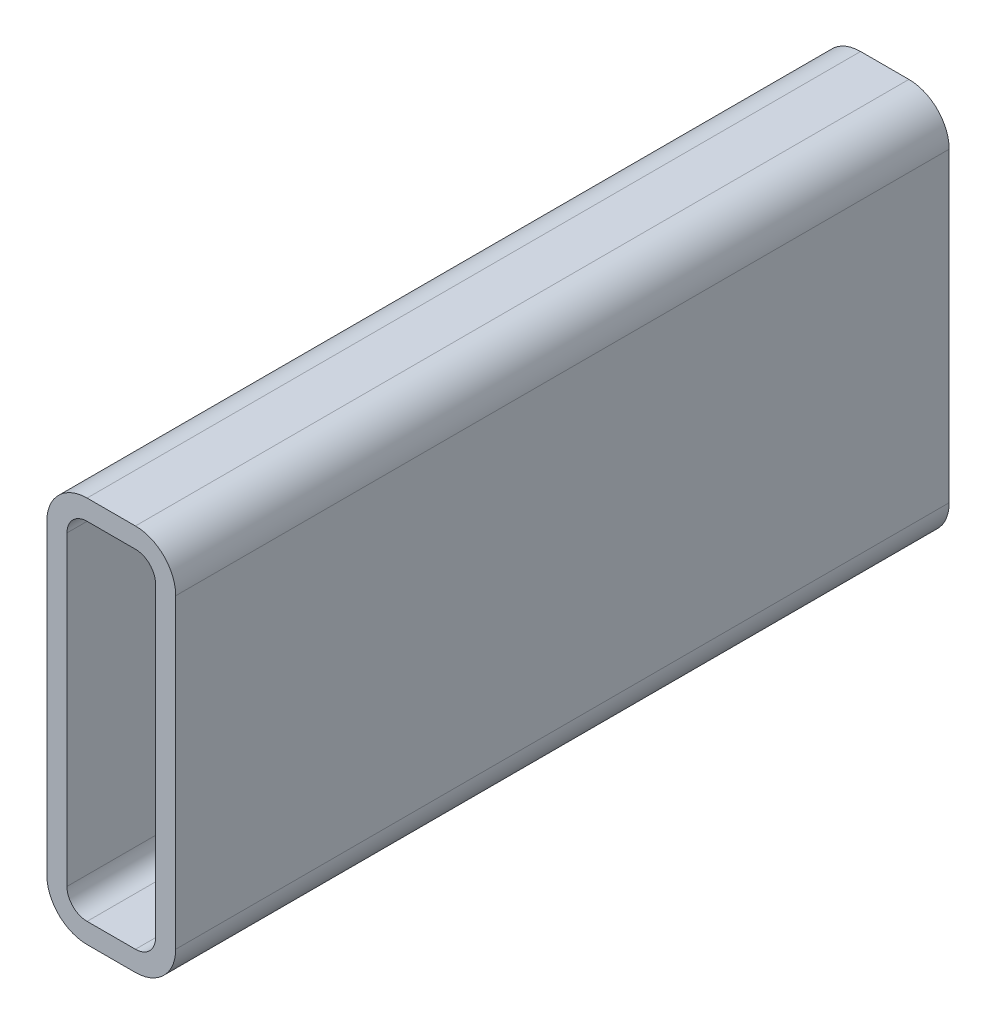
ISO-10303-21;
HEADER;
FILE_DESCRIPTION(('STEP AP214'),'2;1');
FILE_NAME('part.step','',(''),(''),'','','');
FILE_SCHEMA(('AUTOMOTIVE_DESIGN { 1 0 10303 214 1 1 1 1 }'));
ENDSEC;
DATA;
#1=APPLICATION_CONTEXT('core data for automotive mechanical design processes');
#2=APPLICATION_PROTOCOL_DEFINITION('international standard','automotive_design',2000,#1);
#3=PRODUCT_CONTEXT('',#1,'mechanical');
#4=PRODUCT('Part','Part','',(#3));
#5=PRODUCT_RELATED_PRODUCT_CATEGORY('part','',(#4));
#6=PRODUCT_DEFINITION_FORMATION('','',#4);
#7=PRODUCT_DEFINITION_CONTEXT('part definition',#1,'design');
#8=PRODUCT_DEFINITION('design','',#6,#7);
#9=PRODUCT_DEFINITION_SHAPE('','',#8);
#10=(LENGTH_UNIT() NAMED_UNIT(*) SI_UNIT(.MILLI.,.METRE.));
#11=(NAMED_UNIT(*) PLANE_ANGLE_UNIT() SI_UNIT($,.RADIAN.));
#12=(NAMED_UNIT(*) SI_UNIT($,.STERADIAN.) SOLID_ANGLE_UNIT());
#13=UNCERTAINTY_MEASURE_WITH_UNIT(LENGTH_MEASURE(1.E-05),#10,'distance_accuracy_value','');
#14=(GEOMETRIC_REPRESENTATION_CONTEXT(3) GLOBAL_UNCERTAINTY_ASSIGNED_CONTEXT((#13)) GLOBAL_UNIT_ASSIGNED_CONTEXT((#10,
#11,#12)) REPRESENTATION_CONTEXT('',''));
#15=CARTESIAN_POINT('',(0.,0.,0.));
#16=DIRECTION('',(0.,0.,1.));
#17=DIRECTION('',(1.,0.,0.));
#18=AXIS2_PLACEMENT_3D('',#15,#16,#17);
#19=CARTESIAN_POINT('',(15.875,136.525,304.8));
#20=DIRECTION('',(0.,0.,1.));
#21=DIRECTION('',(1.,0.,0.));
#22=AXIS2_PLACEMENT_3D('',#19,#20,#21);
#23=PLANE('',#22);
#24=CARTESIAN_POINT('',(15.875,136.525,304.8));
#25=DIRECTION('',(0.,0.,1.));
#26=DIRECTION('',(1.,0.,0.));
#27=AXIS2_PLACEMENT_3D('',#24,#25,#26);
#28=CIRCLE('',#27,15.875);
#29=CARTESIAN_POINT('',(15.875,152.4,304.8));
#30=VERTEX_POINT('',#29);
#31=CARTESIAN_POINT('',(0.,136.525,304.8));
#32=VERTEX_POINT('',#31);
#33=EDGE_CURVE('E211',#30,#32,#28,.T.);
#34=ORIENTED_EDGE('',*,*,#33,.T.);
#35=DIRECTION('',(0.,-1.,0.));
#36=VECTOR('',#35,1.);
#37=CARTESIAN_POINT('',(0.,15.875,304.8));
#38=LINE('',#37,#36);
#39=CARTESIAN_POINT('',(0.,15.875,304.8));
#40=VERTEX_POINT('',#39);
#41=EDGE_CURVE('E214',#32,#40,#38,.T.);
#42=ORIENTED_EDGE('',*,*,#41,.T.);
#43=CARTESIAN_POINT('',(15.875,15.875,304.8));
#44=DIRECTION('',(0.,0.,1.));
#45=DIRECTION('',(1.,0.,0.));
#46=AXIS2_PLACEMENT_3D('',#43,#44,#45);
#47=CIRCLE('',#46,15.875);
#48=CARTESIAN_POINT('',(15.875,0.,304.8));
#49=VERTEX_POINT('',#48);
#50=EDGE_CURVE('E217',#40,#49,#47,.T.);
#51=ORIENTED_EDGE('',*,*,#50,.T.);
#52=DIRECTION('',(1.,0.,0.));
#53=VECTOR('',#52,1.);
#54=CARTESIAN_POINT('',(34.925,0.,304.8));
#55=LINE('',#54,#53);
#56=CARTESIAN_POINT('',(34.925,0.,304.8));
#57=VERTEX_POINT('',#56);
#58=EDGE_CURVE('E219',#49,#57,#55,.T.);
#59=ORIENTED_EDGE('',*,*,#58,.T.);
#60=CARTESIAN_POINT('',(34.925,15.875,304.8));
#61=DIRECTION('',(0.,0.,1.));
#62=DIRECTION('',(1.,0.,0.));
#63=AXIS2_PLACEMENT_3D('',#60,#61,#62);
#64=CIRCLE('',#63,15.875);
#65=CARTESIAN_POINT('',(50.8,15.875,304.8));
#66=VERTEX_POINT('',#65);
#67=EDGE_CURVE('E221',#57,#66,#64,.T.);
#68=ORIENTED_EDGE('',*,*,#67,.T.);
#69=DIRECTION('',(0.,1.,0.));
#70=VECTOR('',#69,1.);
#71=CARTESIAN_POINT('',(50.8,136.525,304.8));
#72=LINE('',#71,#70);
#73=CARTESIAN_POINT('',(50.8,136.525,304.8));
#74=VERTEX_POINT('',#73);
#75=EDGE_CURVE('E223',#66,#74,#72,.T.);
#76=ORIENTED_EDGE('',*,*,#75,.T.);
#77=CARTESIAN_POINT('',(34.925,136.525,304.8));
#78=DIRECTION('',(0.,0.,1.));
#79=DIRECTION('',(1.,0.,0.));
#80=AXIS2_PLACEMENT_3D('',#77,#78,#79);
#81=CIRCLE('',#80,15.875);
#82=CARTESIAN_POINT('',(34.925,152.4,304.8));
#83=VERTEX_POINT('',#82);
#84=EDGE_CURVE('E225',#74,#83,#81,.T.);
#85=ORIENTED_EDGE('',*,*,#84,.T.);
#86=DIRECTION('',(-1.,0.,0.));
#87=VECTOR('',#86,1.);
#88=CARTESIAN_POINT('',(15.875,152.4,304.8));
#89=LINE('',#88,#87);
#90=EDGE_CURVE('E227',#83,#30,#89,.T.);
#91=ORIENTED_EDGE('',*,*,#90,.T.);
#92=EDGE_LOOP('',(#34,#42,#51,#59,#68,#76,#85,#91));
#93=FACE_BOUND('',#92,.T.);
#94=DIRECTION('',(0.,-1.,0.));
#95=VECTOR('',#94,1.);
#96=CARTESIAN_POINT('',(7.9375,15.875,304.8));
#97=LINE('',#96,#95);
#98=CARTESIAN_POINT('',(7.9375,136.525,304.8));
#99=VERTEX_POINT('',#98);
#100=CARTESIAN_POINT('',(7.9375,15.875,304.8));
#101=VERTEX_POINT('',#100);
#102=EDGE_CURVE('E154',#99,#101,#97,.T.);
#103=ORIENTED_EDGE('',*,*,#102,.F.);
#104=CARTESIAN_POINT('',(15.875,136.525,304.8));
#105=DIRECTION('',(0.,0.,1.));
#106=DIRECTION('',(1.,0.,0.));
#107=AXIS2_PLACEMENT_3D('',#104,#105,#106);
#108=CIRCLE('',#107,7.93750000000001);
#109=CARTESIAN_POINT('',(15.875,144.4625,304.8));
#110=VERTEX_POINT('',#109);
#111=EDGE_CURVE('E146',#110,#99,#108,.T.);
#112=ORIENTED_EDGE('',*,*,#111,.F.);
#113=DIRECTION('',(-1.,0.,0.));
#114=VECTOR('',#113,1.);
#115=CARTESIAN_POINT('',(15.875,144.4625,304.8));
#116=LINE('',#115,#114);
#117=CARTESIAN_POINT('',(34.925,144.4625,304.8));
#118=VERTEX_POINT('',#117);
#119=EDGE_CURVE('E179',#118,#110,#116,.T.);
#120=ORIENTED_EDGE('',*,*,#119,.F.);
#121=CARTESIAN_POINT('',(34.925,136.525,304.8));
#122=DIRECTION('',(0.,0.,1.));
#123=DIRECTION('',(1.,0.,0.));
#124=AXIS2_PLACEMENT_3D('',#121,#122,#123);
#125=CIRCLE('',#124,7.9375);
#126=CARTESIAN_POINT('',(42.8625,136.525,304.8));
#127=VERTEX_POINT('',#126);
#128=EDGE_CURVE('E177',#127,#118,#125,.T.);
#129=ORIENTED_EDGE('',*,*,#128,.F.);
#130=DIRECTION('',(0.,1.,0.));
#131=VECTOR('',#130,1.);
#132=CARTESIAN_POINT('',(42.8625,136.525,304.8));
#133=LINE('',#132,#131);
#134=CARTESIAN_POINT('',(42.8625,15.875,304.8));
#135=VERTEX_POINT('',#134);
#136=EDGE_CURVE('E175',#135,#127,#133,.T.);
#137=ORIENTED_EDGE('',*,*,#136,.F.);
#138=CARTESIAN_POINT('',(34.925,15.875,304.8));
#139=DIRECTION('',(0.,0.,1.));
#140=DIRECTION('',(1.,0.,0.));
#141=AXIS2_PLACEMENT_3D('',#138,#139,#140);
#142=CIRCLE('',#141,7.9375);
#143=CARTESIAN_POINT('',(34.925,7.9375,304.8));
#144=VERTEX_POINT('',#143);
#145=EDGE_CURVE('E173',#144,#135,#142,.T.);
#146=ORIENTED_EDGE('',*,*,#145,.F.);
#147=DIRECTION('',(1.,0.,0.));
#148=VECTOR('',#147,1.);
#149=CARTESIAN_POINT('',(34.925,7.9375,304.8));
#150=LINE('',#149,#148);
#151=CARTESIAN_POINT('',(15.875,7.9375,304.8));
#152=VERTEX_POINT('',#151);
#153=EDGE_CURVE('E169',#152,#144,#150,.T.);
#154=ORIENTED_EDGE('',*,*,#153,.F.);
#155=CARTESIAN_POINT('',(15.875,15.875,304.8));
#156=DIRECTION('',(0.,0.,1.));
#157=DIRECTION('',(1.,0.,0.));
#158=AXIS2_PLACEMENT_3D('',#155,#156,#157);
#159=CIRCLE('',#158,7.9375);
#160=EDGE_CURVE('E167',#101,#152,#159,.T.);
#161=ORIENTED_EDGE('',*,*,#160,.F.);
#162=EDGE_LOOP('',(#103,#112,#120,#129,#137,#146,#154,#161));
#163=FACE_BOUND('',#162,.T.);
#164=ADVANCED_FACE('F33',(#93,#163),#23,.T.);
#165=CARTESIAN_POINT('',(15.875,136.525,0.));
#166=DIRECTION('',(0.,0.,1.));
#167=DIRECTION('',(1.,0.,0.));
#168=AXIS2_PLACEMENT_3D('',#165,#166,#167);
#169=PLANE('',#168);
#170=CARTESIAN_POINT('',(15.875,136.525,0.));
#171=DIRECTION('',(0.,0.,1.));
#172=DIRECTION('',(1.,0.,0.));
#173=AXIS2_PLACEMENT_3D('',#170,#171,#172);
#174=CIRCLE('',#173,15.875);
#175=CARTESIAN_POINT('',(15.875,152.4,0.));
#176=VERTEX_POINT('',#175);
#177=CARTESIAN_POINT('',(0.,136.525,0.));
#178=VERTEX_POINT('',#177);
#179=EDGE_CURVE('E162',#176,#178,#174,.T.);
#180=ORIENTED_EDGE('',*,*,#179,.F.);
#181=DIRECTION('',(-1.,0.,0.));
#182=VECTOR('',#181,1.);
#183=CARTESIAN_POINT('',(15.875,152.4,0.));
#184=LINE('',#183,#182);
#185=CARTESIAN_POINT('',(34.925,152.4,0.));
#186=VERTEX_POINT('',#185);
#187=EDGE_CURVE('E215',#186,#176,#184,.T.);
#188=ORIENTED_EDGE('',*,*,#187,.F.);
#189=CARTESIAN_POINT('',(34.925,136.525,0.));
#190=DIRECTION('',(0.,0.,1.));
#191=DIRECTION('',(1.,0.,0.));
#192=AXIS2_PLACEMENT_3D('',#189,#190,#191);
#193=CIRCLE('',#192,15.875);
#194=CARTESIAN_POINT('',(50.8,136.525,0.));
#195=VERTEX_POINT('',#194);
#196=EDGE_CURVE('E242',#195,#186,#193,.T.);
#197=ORIENTED_EDGE('',*,*,#196,.F.);
#198=DIRECTION('',(0.,1.,0.));
#199=VECTOR('',#198,1.);
#200=CARTESIAN_POINT('',(50.8,136.525,0.));
#201=LINE('',#200,#199);
#202=CARTESIAN_POINT('',(50.8,15.875,0.));
#203=VERTEX_POINT('',#202);
#204=EDGE_CURVE('E240',#203,#195,#201,.T.);
#205=ORIENTED_EDGE('',*,*,#204,.F.);
#206=CARTESIAN_POINT('',(34.925,15.875,0.));
#207=DIRECTION('',(0.,0.,1.));
#208=DIRECTION('',(1.,0.,0.));
#209=AXIS2_PLACEMENT_3D('',#206,#207,#208);
#210=CIRCLE('',#209,15.875);
#211=CARTESIAN_POINT('',(34.925,0.,0.));
#212=VERTEX_POINT('',#211);
#213=EDGE_CURVE('E238',#212,#203,#210,.T.);
#214=ORIENTED_EDGE('',*,*,#213,.F.);
#215=DIRECTION('',(1.,0.,0.));
#216=VECTOR('',#215,1.);
#217=CARTESIAN_POINT('',(34.925,0.,0.));
#218=LINE('',#217,#216);
#219=CARTESIAN_POINT('',(15.875,0.,0.));
#220=VERTEX_POINT('',#219);
#221=EDGE_CURVE('E236',#220,#212,#218,.T.);
#222=ORIENTED_EDGE('',*,*,#221,.F.);
#223=CARTESIAN_POINT('',(15.875,15.875,0.));
#224=DIRECTION('',(0.,0.,1.));
#225=DIRECTION('',(1.,0.,0.));
#226=AXIS2_PLACEMENT_3D('',#223,#224,#225);
#227=CIRCLE('',#226,15.875);
#228=CARTESIAN_POINT('',(0.,15.875,0.));
#229=VERTEX_POINT('',#228);
#230=EDGE_CURVE('E234',#229,#220,#227,.T.);
#231=ORIENTED_EDGE('',*,*,#230,.F.);
#232=DIRECTION('',(0.,-1.,0.));
#233=VECTOR('',#232,1.);
#234=CARTESIAN_POINT('',(0.,15.875,0.));
#235=LINE('',#234,#233);
#236=EDGE_CURVE('E232',#178,#229,#235,.T.);
#237=ORIENTED_EDGE('',*,*,#236,.F.);
#238=EDGE_LOOP('',(#180,#188,#197,#205,#214,#222,#231,#237));
#239=FACE_BOUND('',#238,.T.);
#240=CARTESIAN_POINT('',(15.875,136.525,0.));
#241=DIRECTION('',(0.,0.,1.));
#242=DIRECTION('',(1.,0.,0.));
#243=AXIS2_PLACEMENT_3D('',#240,#241,#242);
#244=CIRCLE('',#243,7.93750000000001);
#245=CARTESIAN_POINT('',(15.875,144.4625,0.));
#246=VERTEX_POINT('',#245);
#247=CARTESIAN_POINT('',(7.9375,136.525,0.));
#248=VERTEX_POINT('',#247);
#249=EDGE_CURVE('E56',#246,#248,#244,.T.);
#250=ORIENTED_EDGE('',*,*,#249,.T.);
#251=DIRECTION('',(0.,-1.,0.));
#252=VECTOR('',#251,1.);
#253=CARTESIAN_POINT('',(7.9375,15.875,0.));
#254=LINE('',#253,#252);
#255=CARTESIAN_POINT('',(7.9375,15.875,0.));
#256=VERTEX_POINT('',#255);
#257=EDGE_CURVE('E161',#248,#256,#254,.T.);
#258=ORIENTED_EDGE('',*,*,#257,.T.);
#259=CARTESIAN_POINT('',(15.875,15.875,0.));
#260=DIRECTION('',(0.,0.,1.));
#261=DIRECTION('',(1.,0.,0.));
#262=AXIS2_PLACEMENT_3D('',#259,#260,#261);
#263=CIRCLE('',#262,7.9375);
#264=CARTESIAN_POINT('',(15.875,7.9375,0.));
#265=VERTEX_POINT('',#264);
#266=EDGE_CURVE('E183',#256,#265,#263,.T.);
#267=ORIENTED_EDGE('',*,*,#266,.T.);
#268=DIRECTION('',(1.,0.,0.));
#269=VECTOR('',#268,1.);
#270=CARTESIAN_POINT('',(34.925,7.9375,0.));
#271=LINE('',#270,#269);
#272=CARTESIAN_POINT('',(34.925,7.9375,0.));
#273=VERTEX_POINT('',#272);
#274=EDGE_CURVE('E186',#265,#273,#271,.T.);
#275=ORIENTED_EDGE('',*,*,#274,.T.);
#276=CARTESIAN_POINT('',(34.925,15.875,0.));
#277=DIRECTION('',(0.,0.,1.));
#278=DIRECTION('',(1.,0.,0.));
#279=AXIS2_PLACEMENT_3D('',#276,#277,#278);
#280=CIRCLE('',#279,7.9375);
#281=CARTESIAN_POINT('',(42.8625,15.875,0.));
#282=VERTEX_POINT('',#281);
#283=EDGE_CURVE('E189',#273,#282,#280,.T.);
#284=ORIENTED_EDGE('',*,*,#283,.T.);
#285=DIRECTION('',(0.,1.,0.));
#286=VECTOR('',#285,1.);
#287=CARTESIAN_POINT('',(42.8625,136.525,0.));
#288=LINE('',#287,#286);
#289=CARTESIAN_POINT('',(42.8625,136.525,0.));
#290=VERTEX_POINT('',#289);
#291=EDGE_CURVE('E192',#282,#290,#288,.T.);
#292=ORIENTED_EDGE('',*,*,#291,.T.);
#293=CARTESIAN_POINT('',(34.925,136.525,0.));
#294=DIRECTION('',(0.,0.,1.));
#295=DIRECTION('',(1.,0.,0.));
#296=AXIS2_PLACEMENT_3D('',#293,#294,#295);
#297=CIRCLE('',#296,7.9375);
#298=CARTESIAN_POINT('',(34.925,144.4625,0.));
#299=VERTEX_POINT('',#298);
#300=EDGE_CURVE('E195',#290,#299,#297,.T.);
#301=ORIENTED_EDGE('',*,*,#300,.T.);
#302=DIRECTION('',(-1.,0.,0.));
#303=VECTOR('',#302,1.);
#304=CARTESIAN_POINT('',(15.875,144.4625,0.));
#305=LINE('',#304,#303);
#306=EDGE_CURVE('E155',#299,#246,#305,.T.);
#307=ORIENTED_EDGE('',*,*,#306,.T.);
#308=EDGE_LOOP('',(#250,#258,#267,#275,#284,#292,#301,#307));
#309=FACE_BOUND('',#308,.T.);
#310=ADVANCED_FACE('F272',(#239,#309),#169,.F.);
#311=CARTESIAN_POINT('',(15.875,136.525,304.8));
#312=DIRECTION('',(0.,0.,-1.));
#313=DIRECTION('',(-1.,0.,0.));
#314=AXIS2_PLACEMENT_3D('',#311,#312,#313);
#315=CYLINDRICAL_SURFACE('',#314,15.875);
#316=ORIENTED_EDGE('',*,*,#179,.T.);
#317=DIRECTION('',(0.,0.,-1.));
#318=VECTOR('',#317,1.);
#319=CARTESIAN_POINT('',(0.,136.525,304.8));
#320=LINE('',#319,#318);
#321=EDGE_CURVE('E11',#32,#178,#320,.T.);
#322=ORIENTED_EDGE('',*,*,#321,.F.);
#323=ORIENTED_EDGE('',*,*,#33,.F.);
#324=DIRECTION('',(0.,0.,-1.));
#325=VECTOR('',#324,1.);
#326=CARTESIAN_POINT('',(15.875,152.4,304.8));
#327=LINE('',#326,#325);
#328=EDGE_CURVE('E229',#30,#176,#327,.T.);
#329=ORIENTED_EDGE('',*,*,#328,.T.);
#330=EDGE_LOOP('',(#316,#322,#323,#329));
#331=FACE_BOUND('',#330,.T.);
#332=ADVANCED_FACE('F35',(#331),#315,.T.);
#333=CARTESIAN_POINT('',(0.,15.875,304.8));
#334=DIRECTION('',(1.,0.,0.));
#335=DIRECTION('',(0.,0.,-1.));
#336=AXIS2_PLACEMENT_3D('',#333,#334,#335);
#337=PLANE('',#336);
#338=ORIENTED_EDGE('',*,*,#236,.T.);
#339=DIRECTION('',(0.,0.,-1.));
#340=VECTOR('',#339,1.);
#341=CARTESIAN_POINT('',(0.,15.875,304.8));
#342=LINE('',#341,#340);
#343=EDGE_CURVE('E41',#40,#229,#342,.T.);
#344=ORIENTED_EDGE('',*,*,#343,.F.);
#345=ORIENTED_EDGE('',*,*,#41,.F.);
#346=ORIENTED_EDGE('',*,*,#321,.T.);
#347=EDGE_LOOP('',(#338,#344,#345,#346));
#348=FACE_BOUND('',#347,.T.);
#349=ADVANCED_FACE('F289',(#348),#337,.F.);
#350=CARTESIAN_POINT('',(15.875,15.875,304.8));
#351=DIRECTION('',(0.,0.,-1.));
#352=DIRECTION('',(-1.,0.,0.));
#353=AXIS2_PLACEMENT_3D('',#350,#351,#352);
#354=CYLINDRICAL_SURFACE('',#353,15.875);
#355=ORIENTED_EDGE('',*,*,#230,.T.);
#356=DIRECTION('',(0.,0.,-1.));
#357=VECTOR('',#356,1.);
#358=CARTESIAN_POINT('',(15.875,0.,304.8));
#359=LINE('',#358,#357);
#360=EDGE_CURVE('E259',#49,#220,#359,.T.);
#361=ORIENTED_EDGE('',*,*,#360,.F.);
#362=ORIENTED_EDGE('',*,*,#50,.F.);
#363=ORIENTED_EDGE('',*,*,#343,.T.);
#364=EDGE_LOOP('',(#355,#361,#362,#363));
#365=FACE_BOUND('',#364,.T.);
#366=ADVANCED_FACE('F266',(#365),#354,.T.);
#367=CARTESIAN_POINT('',(34.925,0.,304.8));
#368=DIRECTION('',(0.,1.,0.));
#369=DIRECTION('',(0.,0.,1.));
#370=AXIS2_PLACEMENT_3D('',#367,#368,#369);
#371=PLANE('',#370);
#372=ORIENTED_EDGE('',*,*,#221,.T.);
#373=DIRECTION('',(0.,0.,-1.));
#374=VECTOR('',#373,1.);
#375=CARTESIAN_POINT('',(34.925,0.,304.8));
#376=LINE('',#375,#374);
#377=EDGE_CURVE('E256',#57,#212,#376,.T.);
#378=ORIENTED_EDGE('',*,*,#377,.F.);
#379=ORIENTED_EDGE('',*,*,#58,.F.);
#380=ORIENTED_EDGE('',*,*,#360,.T.);
#381=EDGE_LOOP('',(#372,#378,#379,#380));
#382=FACE_BOUND('',#381,.T.);
#383=ADVANCED_FACE('F278',(#382),#371,.F.);
#384=CARTESIAN_POINT('',(34.925,15.875,304.8));
#385=DIRECTION('',(0.,0.,-1.));
#386=DIRECTION('',(-1.,0.,0.));
#387=AXIS2_PLACEMENT_3D('',#384,#385,#386);
#388=CYLINDRICAL_SURFACE('',#387,15.875);
#389=ORIENTED_EDGE('',*,*,#213,.T.);
#390=DIRECTION('',(0.,0.,-1.));
#391=VECTOR('',#390,1.);
#392=CARTESIAN_POINT('',(50.8,15.875,304.8));
#393=LINE('',#392,#391);
#394=EDGE_CURVE('E253',#66,#203,#393,.T.);
#395=ORIENTED_EDGE('',*,*,#394,.F.);
#396=ORIENTED_EDGE('',*,*,#67,.F.);
#397=ORIENTED_EDGE('',*,*,#377,.T.);
#398=EDGE_LOOP('',(#389,#395,#396,#397));
#399=FACE_BOUND('',#398,.T.);
#400=ADVANCED_FACE('F282',(#399),#388,.T.);
#401=CARTESIAN_POINT('',(50.8,136.525,304.8));
#402=DIRECTION('',(-1.,0.,0.));
#403=DIRECTION('',(0.,0.,1.));
#404=AXIS2_PLACEMENT_3D('',#401,#402,#403);
#405=PLANE('',#404);
#406=ORIENTED_EDGE('',*,*,#204,.T.);
#407=DIRECTION('',(0.,0.,-1.));
#408=VECTOR('',#407,1.);
#409=CARTESIAN_POINT('',(50.8,136.525,304.8));
#410=LINE('',#409,#408);
#411=EDGE_CURVE('E250',#74,#195,#410,.T.);
#412=ORIENTED_EDGE('',*,*,#411,.F.);
#413=ORIENTED_EDGE('',*,*,#75,.F.);
#414=ORIENTED_EDGE('',*,*,#394,.T.);
#415=EDGE_LOOP('',(#406,#412,#413,#414));
#416=FACE_BOUND('',#415,.T.);
#417=ADVANCED_FACE('F302',(#416),#405,.F.);
#418=CARTESIAN_POINT('',(34.925,136.525,304.8));
#419=DIRECTION('',(0.,0.,-1.));
#420=DIRECTION('',(-1.,0.,0.));
#421=AXIS2_PLACEMENT_3D('',#418,#419,#420);
#422=CYLINDRICAL_SURFACE('',#421,15.875);
#423=ORIENTED_EDGE('',*,*,#196,.T.);
#424=DIRECTION('',(0.,0.,-1.));
#425=VECTOR('',#424,1.);
#426=CARTESIAN_POINT('',(34.925,152.4,304.8));
#427=LINE('',#426,#425);
#428=EDGE_CURVE('E247',#83,#186,#427,.T.);
#429=ORIENTED_EDGE('',*,*,#428,.F.);
#430=ORIENTED_EDGE('',*,*,#84,.F.);
#431=ORIENTED_EDGE('',*,*,#411,.T.);
#432=EDGE_LOOP('',(#423,#429,#430,#431));
#433=FACE_BOUND('',#432,.T.);
#434=ADVANCED_FACE('F300',(#433),#422,.T.);
#435=CARTESIAN_POINT('',(15.875,152.4,304.8));
#436=DIRECTION('',(0.,-1.,0.));
#437=DIRECTION('',(0.,0.,-1.));
#438=AXIS2_PLACEMENT_3D('',#435,#436,#437);
#439=PLANE('',#438);
#440=ORIENTED_EDGE('',*,*,#187,.T.);
#441=ORIENTED_EDGE('',*,*,#328,.F.);
#442=ORIENTED_EDGE('',*,*,#90,.F.);
#443=ORIENTED_EDGE('',*,*,#428,.T.);
#444=EDGE_LOOP('',(#440,#441,#442,#443));
#445=FACE_BOUND('',#444,.T.);
#446=ADVANCED_FACE('F295',(#445),#439,.F.);
#447=CARTESIAN_POINT('',(15.875,136.525,304.8));
#448=DIRECTION('',(0.,0.,-1.));
#449=DIRECTION('',(-1.,0.,0.));
#450=AXIS2_PLACEMENT_3D('',#447,#448,#449);
#451=CYLINDRICAL_SURFACE('',#450,7.93750000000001);
#452=ORIENTED_EDGE('',*,*,#249,.F.);
#453=DIRECTION('',(0.,0.,-1.));
#454=VECTOR('',#453,1.);
#455=CARTESIAN_POINT('',(15.875,144.4625,304.8));
#456=LINE('',#455,#454);
#457=EDGE_CURVE('E150',#110,#246,#456,.T.);
#458=ORIENTED_EDGE('',*,*,#457,.F.);
#459=ORIENTED_EDGE('',*,*,#111,.T.);
#460=DIRECTION('',(0.,0.,-1.));
#461=VECTOR('',#460,1.);
#462=CARTESIAN_POINT('',(7.9375,136.525,304.8));
#463=LINE('',#462,#461);
#464=EDGE_CURVE('E149',#99,#248,#463,.T.);
#465=ORIENTED_EDGE('',*,*,#464,.T.);
#466=EDGE_LOOP('',(#452,#458,#459,#465));
#467=FACE_BOUND('',#466,.T.);
#468=ADVANCED_FACE('F148',(#467),#451,.F.);
#469=CARTESIAN_POINT('',(7.9375,15.875,304.8));
#470=DIRECTION('',(1.,0.,0.));
#471=DIRECTION('',(0.,0.,-1.));
#472=AXIS2_PLACEMENT_3D('',#469,#470,#471);
#473=PLANE('',#472);
#474=ORIENTED_EDGE('',*,*,#257,.F.);
#475=ORIENTED_EDGE('',*,*,#464,.F.);
#476=ORIENTED_EDGE('',*,*,#102,.T.);
#477=DIRECTION('',(0.,0.,-1.));
#478=VECTOR('',#477,1.);
#479=CARTESIAN_POINT('',(7.9375,15.875,304.8));
#480=LINE('',#479,#478);
#481=EDGE_CURVE('E163',#101,#256,#480,.T.);
#482=ORIENTED_EDGE('',*,*,#481,.T.);
#483=EDGE_LOOP('',(#474,#475,#476,#482));
#484=FACE_BOUND('',#483,.T.);
#485=ADVANCED_FACE('F158',(#484),#473,.T.);
#486=CARTESIAN_POINT('',(15.875,15.875,304.8));
#487=DIRECTION('',(0.,0.,-1.));
#488=DIRECTION('',(-1.,0.,0.));
#489=AXIS2_PLACEMENT_3D('',#486,#487,#488);
#490=CYLINDRICAL_SURFACE('',#489,7.9375);
#491=ORIENTED_EDGE('',*,*,#266,.F.);
#492=ORIENTED_EDGE('',*,*,#481,.F.);
#493=ORIENTED_EDGE('',*,*,#160,.T.);
#494=DIRECTION('',(0.,0.,-1.));
#495=VECTOR('',#494,1.);
#496=CARTESIAN_POINT('',(15.875,7.9375,304.8));
#497=LINE('',#496,#495);
#498=EDGE_CURVE('E208',#152,#265,#497,.T.);
#499=ORIENTED_EDGE('',*,*,#498,.T.);
#500=EDGE_LOOP('',(#491,#492,#493,#499));
#501=FACE_BOUND('',#500,.T.);
#502=ADVANCED_FACE('F327',(#501),#490,.F.);
#503=CARTESIAN_POINT('',(34.925,7.9375,304.8));
#504=DIRECTION('',(0.,1.,0.));
#505=DIRECTION('',(0.,0.,1.));
#506=AXIS2_PLACEMENT_3D('',#503,#504,#505);
#507=PLANE('',#506);
#508=ORIENTED_EDGE('',*,*,#274,.F.);
#509=ORIENTED_EDGE('',*,*,#498,.F.);
#510=ORIENTED_EDGE('',*,*,#153,.T.);
#511=DIRECTION('',(0.,0.,-1.));
#512=VECTOR('',#511,1.);
#513=CARTESIAN_POINT('',(34.925,7.9375,304.8));
#514=LINE('',#513,#512);
#515=EDGE_CURVE('E206',#144,#273,#514,.T.);
#516=ORIENTED_EDGE('',*,*,#515,.T.);
#517=EDGE_LOOP('',(#508,#509,#510,#516));
#518=FACE_BOUND('',#517,.T.);
#519=ADVANCED_FACE('F331',(#518),#507,.T.);
#520=CARTESIAN_POINT('',(34.925,15.875,304.8));
#521=DIRECTION('',(0.,0.,-1.));
#522=DIRECTION('',(-1.,0.,0.));
#523=AXIS2_PLACEMENT_3D('',#520,#521,#522);
#524=CYLINDRICAL_SURFACE('',#523,7.9375);
#525=ORIENTED_EDGE('',*,*,#283,.F.);
#526=ORIENTED_EDGE('',*,*,#515,.F.);
#527=ORIENTED_EDGE('',*,*,#145,.T.);
#528=DIRECTION('',(0.,0.,-1.));
#529=VECTOR('',#528,1.);
#530=CARTESIAN_POINT('',(42.8625,15.875,304.8));
#531=LINE('',#530,#529);
#532=EDGE_CURVE('E204',#135,#282,#531,.T.);
#533=ORIENTED_EDGE('',*,*,#532,.T.);
#534=EDGE_LOOP('',(#525,#526,#527,#533));
#535=FACE_BOUND('',#534,.T.);
#536=ADVANCED_FACE('F337',(#535),#524,.F.);
#537=CARTESIAN_POINT('',(42.8625,136.525,304.8));
#538=DIRECTION('',(-1.,0.,0.));
#539=DIRECTION('',(0.,0.,1.));
#540=AXIS2_PLACEMENT_3D('',#537,#538,#539);
#541=PLANE('',#540);
#542=ORIENTED_EDGE('',*,*,#291,.F.);
#543=ORIENTED_EDGE('',*,*,#532,.F.);
#544=ORIENTED_EDGE('',*,*,#136,.T.);
#545=DIRECTION('',(0.,0.,-1.));
#546=VECTOR('',#545,1.);
#547=CARTESIAN_POINT('',(42.8625,136.525,304.8));
#548=LINE('',#547,#546);
#549=EDGE_CURVE('E202',#127,#290,#548,.T.);
#550=ORIENTED_EDGE('',*,*,#549,.T.);
#551=EDGE_LOOP('',(#542,#543,#544,#550));
#552=FACE_BOUND('',#551,.T.);
#553=ADVANCED_FACE('F341',(#552),#541,.T.);
#554=CARTESIAN_POINT('',(34.925,136.525,304.8));
#555=DIRECTION('',(0.,0.,-1.));
#556=DIRECTION('',(-1.,0.,0.));
#557=AXIS2_PLACEMENT_3D('',#554,#555,#556);
#558=CYLINDRICAL_SURFACE('',#557,7.9375);
#559=ORIENTED_EDGE('',*,*,#300,.F.);
#560=ORIENTED_EDGE('',*,*,#549,.F.);
#561=ORIENTED_EDGE('',*,*,#128,.T.);
#562=DIRECTION('',(0.,0.,-1.));
#563=VECTOR('',#562,1.);
#564=CARTESIAN_POINT('',(34.925,144.4625,304.8));
#565=LINE('',#564,#563);
#566=EDGE_CURVE('E48',#118,#299,#565,.T.);
#567=ORIENTED_EDGE('',*,*,#566,.T.);
#568=EDGE_LOOP('',(#559,#560,#561,#567));
#569=FACE_BOUND('',#568,.T.);
#570=ADVANCED_FACE('F345',(#569),#558,.F.);
#571=CARTESIAN_POINT('',(15.875,144.4625,304.8));
#572=DIRECTION('',(0.,-1.,0.));
#573=DIRECTION('',(0.,0.,-1.));
#574=AXIS2_PLACEMENT_3D('',#571,#572,#573);
#575=PLANE('',#574);
#576=ORIENTED_EDGE('',*,*,#306,.F.);
#577=ORIENTED_EDGE('',*,*,#566,.F.);
#578=ORIENTED_EDGE('',*,*,#119,.T.);
#579=ORIENTED_EDGE('',*,*,#457,.T.);
#580=EDGE_LOOP('',(#576,#577,#578,#579));
#581=FACE_BOUND('',#580,.T.);
#582=ADVANCED_FACE('F349',(#581),#575,.T.);
#583=CLOSED_SHELL('',(#164,#310,#332,#349,#366,#383,#400,#417,#434,#446,#468,#485,#502,#519,
#536,#553,#570,#582));
#584=MANIFOLD_SOLID_BREP('B2',#583);
#585=ADVANCED_BREP_SHAPE_REPRESENTATION('',(#18,#584),#14);
#586=SHAPE_DEFINITION_REPRESENTATION(#9,#585);
ENDSEC;
END-ISO-10303-21;
